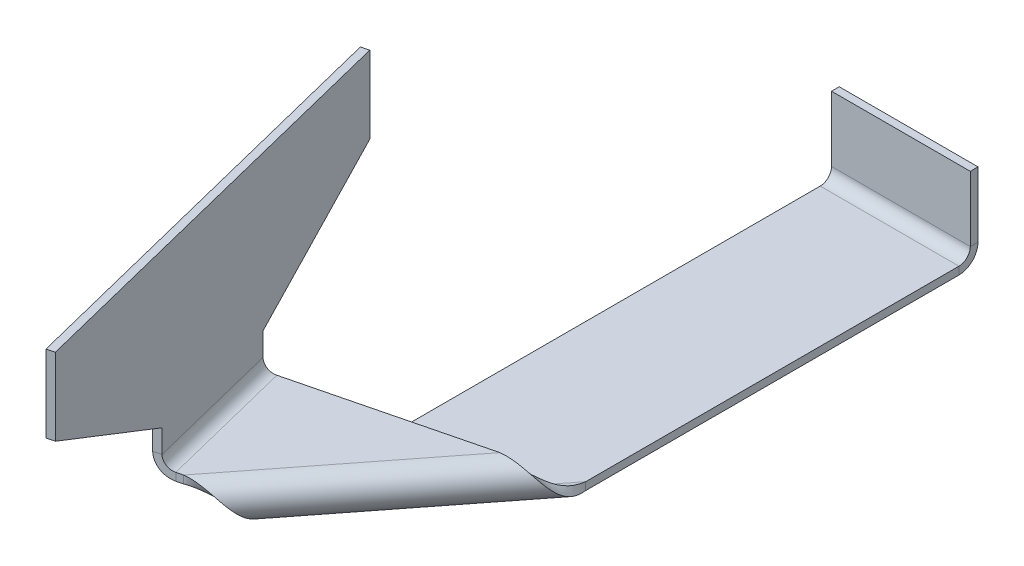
ISO-10303-21;
HEADER;
FILE_DESCRIPTION(('STEP AP214'),'2;1');
FILE_NAME('part.step','',(''),(''),'','','');
FILE_SCHEMA(('AUTOMOTIVE_DESIGN { 1 0 10303 214 1 1 1 1 }'));
ENDSEC;
DATA;
#1=APPLICATION_CONTEXT('core data for automotive mechanical design processes');
#2=APPLICATION_PROTOCOL_DEFINITION('international standard','automotive_design',2000,#1);
#3=PRODUCT_CONTEXT('',#1,'mechanical');
#4=PRODUCT('Part','Part','',(#3));
#5=PRODUCT_RELATED_PRODUCT_CATEGORY('part','',(#4));
#6=PRODUCT_DEFINITION_FORMATION('','',#4);
#7=PRODUCT_DEFINITION_CONTEXT('part definition',#1,'design');
#8=PRODUCT_DEFINITION('design','',#6,#7);
#9=PRODUCT_DEFINITION_SHAPE('','',#8);
#10=(LENGTH_UNIT() NAMED_UNIT(*) SI_UNIT(.MILLI.,.METRE.));
#11=(NAMED_UNIT(*) PLANE_ANGLE_UNIT() SI_UNIT($,.RADIAN.));
#12=(NAMED_UNIT(*) SI_UNIT($,.STERADIAN.) SOLID_ANGLE_UNIT());
#13=UNCERTAINTY_MEASURE_WITH_UNIT(LENGTH_MEASURE(1.E-05),#10,'distance_accuracy_value','');
#14=(GEOMETRIC_REPRESENTATION_CONTEXT(3) GLOBAL_UNCERTAINTY_ASSIGNED_CONTEXT((#13)) GLOBAL_UNIT_ASSIGNED_CONTEXT((#10,
#11,#12)) REPRESENTATION_CONTEXT('',''));
#15=CARTESIAN_POINT('',(0.,0.,0.));
#16=DIRECTION('',(0.,0.,1.));
#17=DIRECTION('',(1.,0.,0.));
#18=AXIS2_PLACEMENT_3D('',#15,#16,#17);
#19=CARTESIAN_POINT('',(42.7119081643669,-3.48852617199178,28.3319261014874));
#20=DIRECTION('',(0.,1.,0.));
#21=DIRECTION('',(0.241921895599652,0.,0.970295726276));
#22=AXIS2_PLACEMENT_3D('',#19,#20,#21);
#23=PLANE('',#22);
#24=DIRECTION('',(-0.970295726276,0.,0.241921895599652));
#25=VECTOR('',#24,1.);
#26=CARTESIAN_POINT('',(42.7119081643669,-3.48852617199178,28.3319261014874));
#27=LINE('',#26,#25);
#28=CARTESIAN_POINT('',(-2.44243563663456,-3.48852617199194,39.5901684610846));
#29=VERTEX_POINT('',#28);
#30=CARTESIAN_POINT('',(-2.84553811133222,-3.48852617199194,39.6906731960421));
#31=VERTEX_POINT('',#30);
#32=EDGE_CURVE('E89',#29,#31,#27,.T.);
#33=ORIENTED_EDGE('',*,*,#32,.T.);
#34=DIRECTION('',(-0.241921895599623,0.,-0.970295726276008));
#35=VECTOR('',#34,1.);
#36=CARTESIAN_POINT('',(-2.84553811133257,-3.48852617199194,39.6906731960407));
#37=LINE('',#36,#35);
#38=CARTESIAN_POINT('',(-5.02283517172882,-3.48852617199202,30.9580116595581));
#39=VERTEX_POINT('',#38);
#40=EDGE_CURVE('E81',#31,#39,#37,.T.);
#41=ORIENTED_EDGE('',*,*,#40,.T.);
#42=DIRECTION('',(0.970295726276,0.,-0.241921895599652));
#43=VECTOR('',#42,1.);
#44=CARTESIAN_POINT('',(40.53461110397,-3.48852617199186,19.5992645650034));
#45=LINE('',#44,#43);
#46=CARTESIAN_POINT('',(6.55756436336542,-3.48852617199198,28.0706937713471));
#47=VERTEX_POINT('',#46);
#48=EDGE_CURVE('E97',#39,#47,#45,.T.);
#49=ORIENTED_EDGE('',*,*,#48,.T.);
#50=DIRECTION('',(0.615661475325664,0.,-0.788010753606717));
#51=VECTOR('',#50,1.);
#52=CARTESIAN_POINT('',(20.1347362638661,-3.48852617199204,10.6927062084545));
#53=LINE('',#52,#51);
#54=EDGE_CURVE('E519',#29,#47,#53,.T.);
#55=ORIENTED_EDGE('',*,*,#54,.F.);
#56=EDGE_LOOP('',(#33,#41,#49,#55));
#57=FACE_BOUND('',#56,.T.);
#58=ADVANCED_FACE('F71',(#57),#23,.F.);
#59=CARTESIAN_POINT('',(0.,-5.46172617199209,-5.03827382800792));
#60=DIRECTION('',(0.,-1.,0.));
#61=DIRECTION('',(-1.,0.,0.));
#62=AXIS2_PLACEMENT_3D('',#59,#60,#61);
#63=PLANE('',#62);
#64=DIRECTION('',(0.,0.,1.));
#65=VECTOR('',#64,1.);
#66=CARTESIAN_POINT('',(0.,-5.46172617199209,-5.03827382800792));
#67=LINE('',#66,#65);
#68=CARTESIAN_POINT('',(0.,-5.46172617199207,0.736600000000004));
#69=VERTEX_POINT('',#68);
#70=CARTESIAN_POINT('',(0.,-5.46172617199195,36.4639934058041));
#71=VERTEX_POINT('',#70);
#72=EDGE_CURVE('E490',#69,#71,#67,.T.);
#73=ORIENTED_EDGE('',*,*,#72,.F.);
#74=DIRECTION('',(1.,0.,0.));
#75=VECTOR('',#74,1.);
#76=CARTESIAN_POINT('',(0.,-5.46172617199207,0.736600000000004));
#77=LINE('',#76,#75);
#78=CARTESIAN_POINT('',(9.,-5.46172617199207,0.736600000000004));
#79=VERTEX_POINT('',#78);
#80=EDGE_CURVE('E498',#69,#79,#77,.T.);
#81=ORIENTED_EDGE('',*,*,#80,.T.);
#82=DIRECTION('',(0.,0.,-1.));
#83=VECTOR('',#82,1.);
#84=CARTESIAN_POINT('',(9.,-5.46172617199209,-5.03827382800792));
#85=LINE('',#84,#83);
#86=CARTESIAN_POINT('',(9.00000000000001,-5.46172617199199,24.9445187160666));
#87=VERTEX_POINT('',#86);
#88=EDGE_CURVE('E463',#87,#79,#85,.T.);
#89=ORIENTED_EDGE('',*,*,#88,.F.);
#90=DIRECTION('',(0.615661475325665,0.,-0.788010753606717));
#91=VECTOR('',#90,1.);
#92=CARTESIAN_POINT('',(20.1347362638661,-5.46172617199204,10.6927062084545));
#93=LINE('',#92,#91);
#94=EDGE_CURVE('E417',#71,#87,#93,.T.);
#95=ORIENTED_EDGE('',*,*,#94,.F.);
#96=EDGE_LOOP('',(#73,#81,#89,#95));
#97=FACE_BOUND('',#96,.T.);
#98=ADVANCED_FACE('F387',(#97),#63,.T.);
#99=CARTESIAN_POINT('',(0.,-5.46172617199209,-5.03827382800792));
#100=DIRECTION('',(-1.,0.,0.));
#101=DIRECTION('',(0.,0.,1.));
#102=AXIS2_PLACEMENT_3D('',#99,#100,#101);
#103=PLANE('',#102);
#104=DIRECTION('',(0.,0.,1.));
#105=VECTOR('',#104,1.);
#106=CARTESIAN_POINT('',(0.,-4.96172617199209,-5.03827382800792));
#107=LINE('',#106,#105);
#108=CARTESIAN_POINT('',(0.,-4.96172617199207,0.736600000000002));
#109=VERTEX_POINT('',#108);
#110=CARTESIAN_POINT('',(0.,-4.96172617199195,36.4639934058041));
#111=VERTEX_POINT('',#110);
#112=EDGE_CURVE('E489',#109,#111,#107,.T.);
#113=ORIENTED_EDGE('',*,*,#112,.F.);
#114=DIRECTION('',(0.,-1.,0.));
#115=VECTOR('',#114,1.);
#116=CARTESIAN_POINT('',(0.,-5.46172617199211,0.736600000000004));
#117=LINE('',#116,#115);
#118=EDGE_CURVE('E527',#109,#69,#117,.T.);
#119=ORIENTED_EDGE('',*,*,#118,.T.);
#120=ORIENTED_EDGE('',*,*,#72,.T.);
#121=CARTESIAN_POINT('',(0.,-4.96172617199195,36.4639934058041));
#122=CARTESIAN_POINT('',(0.,-5.46172617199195,36.4639934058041));
#123=B_SPLINE_CURVE_WITH_KNOTS('',1,(#121,#122),.UNSPECIFIED.,.F.,.F.,(2,2),(0.,1.),.UNSPECIFIED.);
#124=EDGE_CURVE('E431',#111,#71,#123,.T.);
#125=ORIENTED_EDGE('',*,*,#124,.F.);
#126=EDGE_LOOP('',(#113,#119,#120,#125));
#127=FACE_BOUND('',#126,.T.);
#128=ADVANCED_FACE('F437',(#127),#103,.T.);
#129=CARTESIAN_POINT('',(9.,-5.46172617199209,-5.03827382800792));
#130=DIRECTION('',(1.,0.,0.));
#131=DIRECTION('',(0.,0.,-1.));
#132=AXIS2_PLACEMENT_3D('',#129,#130,#131);
#133=PLANE('',#132);
#134=ORIENTED_EDGE('',*,*,#88,.T.);
#135=DIRECTION('',(0.,1.,0.));
#136=VECTOR('',#135,1.);
#137=CARTESIAN_POINT('',(9.,-5.46172617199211,0.736600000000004));
#138=LINE('',#137,#136);
#139=CARTESIAN_POINT('',(9.,-4.96172617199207,0.736600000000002));
#140=VERTEX_POINT('',#139);
#141=EDGE_CURVE('E478',#79,#140,#138,.T.);
#142=ORIENTED_EDGE('',*,*,#141,.T.);
#143=DIRECTION('',(0.,0.,-1.));
#144=VECTOR('',#143,1.);
#145=CARTESIAN_POINT('',(9.,-4.96172617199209,-5.03827382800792));
#146=LINE('',#145,#144);
#147=CARTESIAN_POINT('',(9.00000000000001,-4.96172617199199,24.9445187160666));
#148=VERTEX_POINT('',#147);
#149=EDGE_CURVE('E472',#148,#140,#146,.T.);
#150=ORIENTED_EDGE('',*,*,#149,.F.);
#151=CARTESIAN_POINT('',(9.00000000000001,-5.46172617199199,24.9445187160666));
#152=CARTESIAN_POINT('',(9.00000000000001,-4.96172617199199,24.9445187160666));
#153=B_SPLINE_CURVE_WITH_KNOTS('',1,(#151,#152),.UNSPECIFIED.,.F.,.F.,(2,2),(0.,1.),.UNSPECIFIED.);
#154=EDGE_CURVE('E413',#87,#148,#153,.T.);
#155=ORIENTED_EDGE('',*,*,#154,.F.);
#156=EDGE_LOOP('',(#134,#142,#150,#155));
#157=FACE_BOUND('',#156,.T.);
#158=ADVANCED_FACE('F446',(#157),#133,.T.);
#159=CARTESIAN_POINT('',(42.7119081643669,-2.98852617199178,28.3319261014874));
#160=DIRECTION('',(0.241921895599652,0.,0.970295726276));
#161=DIRECTION('',(-0.970295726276,0.,0.241921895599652));
#162=AXIS2_PLACEMENT_3D('',#159,#160,#161);
#163=PLANE('',#162);
#164=DIRECTION('',(0.,1.,0.));
#165=VECTOR('',#164,1.);
#166=CARTESIAN_POINT('',(-2.84553811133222,-2.98852617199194,39.6906731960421));
#167=LINE('',#166,#165);
#168=CARTESIAN_POINT('',(-2.84553811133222,-2.98852617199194,39.6906731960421));
#169=VERTEX_POINT('',#168);
#170=EDGE_CURVE('E12',#31,#169,#167,.T.);
#171=ORIENTED_EDGE('',*,*,#170,.F.);
#172=ORIENTED_EDGE('',*,*,#32,.F.);
#173=CARTESIAN_POINT('',(-2.44243563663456,-2.98852617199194,39.5901684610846));
#174=CARTESIAN_POINT('',(-2.44243563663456,-3.48852617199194,39.5901684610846));
#175=B_SPLINE_CURVE_WITH_KNOTS('',1,(#173,#174),.UNSPECIFIED.,.F.,.F.,(2,2),(0.,1.),.UNSPECIFIED.);
#176=CARTESIAN_POINT('',(-2.44243563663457,-2.98852617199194,39.5901684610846));
#177=VERTEX_POINT('',#176);
#178=EDGE_CURVE('E522',#29,#177,#175,.F.);
#179=ORIENTED_EDGE('',*,*,#178,.T.);
#180=DIRECTION('',(-0.970295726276,0.,0.241921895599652));
#181=VECTOR('',#180,1.);
#182=CARTESIAN_POINT('',(42.7119081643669,-2.98852617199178,28.3319261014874));
#183=LINE('',#182,#181);
#184=EDGE_CURVE('E504',#177,#169,#183,.T.);
#185=ORIENTED_EDGE('',*,*,#184,.T.);
#186=EDGE_LOOP('',(#171,#172,#179,#185));
#187=FACE_BOUND('',#186,.T.);
#188=ADVANCED_FACE('F73',(#187),#163,.T.);
#189=CARTESIAN_POINT('',(40.53461110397,-2.98852617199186,19.5992645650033));
#190=DIRECTION('',(-0.241921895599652,0.,-0.970295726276));
#191=DIRECTION('',(0.970295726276,0.,-0.241921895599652));
#192=AXIS2_PLACEMENT_3D('',#189,#190,#191);
#193=PLANE('',#192);
#194=DIRECTION('',(0.,-1.,0.));
#195=VECTOR('',#194,1.);
#196=CARTESIAN_POINT('',(-5.02283517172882,-2.98852617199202,30.9580116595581));
#197=LINE('',#196,#195);
#198=CARTESIAN_POINT('',(-5.02283517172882,-2.98852617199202,30.9580116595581));
#199=VERTEX_POINT('',#198);
#200=EDGE_CURVE('E537',#199,#39,#197,.T.);
#201=ORIENTED_EDGE('',*,*,#200,.F.);
#202=DIRECTION('',(0.970295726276,0.,-0.241921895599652));
#203=VECTOR('',#202,1.);
#204=CARTESIAN_POINT('',(40.53461110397,-2.98852617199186,19.5992645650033));
#205=LINE('',#204,#203);
#206=CARTESIAN_POINT('',(6.5575643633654,-2.98852617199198,28.0706937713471));
#207=VERTEX_POINT('',#206);
#208=EDGE_CURVE('E502',#199,#207,#205,.T.);
#209=ORIENTED_EDGE('',*,*,#208,.T.);
#210=CARTESIAN_POINT('',(6.55756436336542,-3.48852617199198,28.0706937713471));
#211=CARTESIAN_POINT('',(6.55756436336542,-2.98852617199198,28.0706937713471));
#212=B_SPLINE_CURVE_WITH_KNOTS('',1,(#210,#211),.UNSPECIFIED.,.F.,.F.,(2,2),(0.,1.),.UNSPECIFIED.);
#213=EDGE_CURVE('E521',#207,#47,#212,.F.);
#214=ORIENTED_EDGE('',*,*,#213,.T.);
#215=ORIENTED_EDGE('',*,*,#48,.F.);
#216=EDGE_LOOP('',(#201,#209,#214,#215));
#217=FACE_BOUND('',#216,.T.);
#218=ADVANCED_FACE('F524',(#217),#193,.T.);
#219=CARTESIAN_POINT('',(42.7119081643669,-2.98852617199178,28.3319261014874));
#220=DIRECTION('',(0.,1.,0.));
#221=DIRECTION('',(0.241921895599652,0.,0.970295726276));
#222=AXIS2_PLACEMENT_3D('',#219,#220,#221);
#223=PLANE('',#222);
#224=DIRECTION('',(-0.241921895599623,0.,-0.970295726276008));
#225=VECTOR('',#224,1.);
#226=CARTESIAN_POINT('',(-2.84553811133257,-2.98852617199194,39.6906731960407));
#227=LINE('',#226,#225);
#228=EDGE_CURVE('E507',#169,#199,#227,.T.);
#229=ORIENTED_EDGE('',*,*,#228,.F.);
#230=ORIENTED_EDGE('',*,*,#184,.F.);
#231=DIRECTION('',(0.615661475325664,0.,-0.788010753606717));
#232=VECTOR('',#231,1.);
#233=CARTESIAN_POINT('',(20.1347362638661,-2.98852617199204,10.6927062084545));
#234=LINE('',#233,#232);
#235=EDGE_CURVE('E473',#177,#207,#234,.T.);
#236=ORIENTED_EDGE('',*,*,#235,.T.);
#237=ORIENTED_EDGE('',*,*,#208,.F.);
#238=EDGE_LOOP('',(#229,#230,#236,#237));
#239=FACE_BOUND('',#238,.T.);
#240=ADVANCED_FACE('F450',(#239),#223,.T.);
#241=CARTESIAN_POINT('',(0.,-4.96172617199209,-5.03827382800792));
#242=DIRECTION('',(0.,-1.,0.));
#243=DIRECTION('',(-1.,0.,0.));
#244=AXIS2_PLACEMENT_3D('',#241,#242,#243);
#245=PLANE('',#244);
#246=DIRECTION('',(1.,0.,0.));
#247=VECTOR('',#246,1.);
#248=CARTESIAN_POINT('',(0.,-4.96172617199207,0.736600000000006));
#249=LINE('',#248,#247);
#250=EDGE_CURVE('E531',#109,#140,#249,.T.);
#251=ORIENTED_EDGE('',*,*,#250,.F.);
#252=ORIENTED_EDGE('',*,*,#112,.T.);
#253=DIRECTION('',(0.615661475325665,0.,-0.788010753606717));
#254=VECTOR('',#253,1.);
#255=CARTESIAN_POINT('',(20.1347362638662,-4.96172617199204,10.6927062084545));
#256=LINE('',#255,#254);
#257=EDGE_CURVE('E435',#111,#148,#256,.T.);
#258=ORIENTED_EDGE('',*,*,#257,.T.);
#259=ORIENTED_EDGE('',*,*,#149,.T.);
#260=EDGE_LOOP('',(#251,#252,#258,#259));
#261=FACE_BOUND('',#260,.T.);
#262=ADVANCED_FACE('F447',(#261),#245,.F.);
#263=CARTESIAN_POINT('',(-2.44243563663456,-2.98852617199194,39.5901684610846));
#264=CARTESIAN_POINT('',(-2.21309150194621,-2.98852617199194,39.5595659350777));
#265=CARTESIAN_POINT('',(-1.98383803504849,-3.0207115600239,39.5289295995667));
#266=CARTESIAN_POINT('',(-1.54460945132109,-3.14460192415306,39.4525580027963));
#267=CARTESIAN_POINT('',(-1.33474730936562,-3.23625815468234,39.4067529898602));
#268=CARTESIAN_POINT('',(-0.95081994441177,-3.46517769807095,39.2871753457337));
#269=CARTESIAN_POINT('',(-0.776825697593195,-3.60235094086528,39.2133472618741));
#270=CARTESIAN_POINT('',(-0.47566245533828,-3.90144873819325,39.0291071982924));
#271=CARTESIAN_POINT('',(-0.348531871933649,-4.06325561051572,38.9186652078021));
#272=CARTESIAN_POINT('',(-0.144995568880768,-4.38699673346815,38.6581506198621));
#273=CARTESIAN_POINT('',(-0.0685898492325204,-4.54880360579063,38.5080780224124));
#274=CARTESIAN_POINT('',(0.037319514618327,-4.8479014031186,38.1712889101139));
#275=CARTESIAN_POINT('',(0.0668615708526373,-4.98507464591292,37.9846024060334));
#276=CARTESIAN_POINT('',(0.0900068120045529,-5.21399418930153,37.5831508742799));
#277=CARTESIAN_POINT('',(0.0836809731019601,-5.30565041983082,37.3684412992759));
#278=CARTESIAN_POINT('',(0.0515249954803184,-5.42954078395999,36.9237837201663));
#279=CARTESIAN_POINT('',(0.0257898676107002,-5.46172617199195,36.6939284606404));
#280=CARTESIAN_POINT('',(0.,-5.46172617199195,36.4639934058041));
#281=CARTESIAN_POINT('',(-2.44243563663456,-3.48852617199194,39.5901684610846));
#282=CARTESIAN_POINT('',(-2.26467878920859,-3.48852617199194,39.5192704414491));
#283=CARTESIAN_POINT('',(-2.08696810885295,-3.50769789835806,39.4483555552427));
#284=CARTESIAN_POINT('',(-1.74303803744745,-3.58149511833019,39.2975286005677));
#285=CARTESIAN_POINT('',(-1.5768820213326,-3.63609157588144,39.2175766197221));
#286=CARTESIAN_POINT('',(-1.26589297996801,-3.77245105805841,39.0410133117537));
#287=CARTESIAN_POINT('',(-1.12110223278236,-3.85416043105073,38.9443689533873));
#288=CARTESIAN_POINT('',(-0.859412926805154,-4.03232268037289,38.7292884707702));
#289=CARTESIAN_POINT('',(-0.742537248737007,-4.12870545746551,38.6108344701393));
#290=CARTESIAN_POINT('',(-0.539000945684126,-4.32154688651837,38.3503198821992));
#291=CARTESIAN_POINT('',(-0.452340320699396,-4.41792966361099,38.2082592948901));
#292=CARTESIAN_POINT('',(-0.306957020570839,-4.59609191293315,37.9023106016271));
#293=CARTESIAN_POINT('',(-0.248211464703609,-4.67780128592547,37.7384403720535));
#294=CARTESIAN_POINT('',(-0.152127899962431,-4.81416076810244,37.3939745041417));
#295=CARTESIAN_POINT('',(-0.114747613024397,-4.86875722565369,37.2134118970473));
#296=CARTESIAN_POINT('',(-0.0516050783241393,-4.94255444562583,36.8432096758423));
#297=CARTESIAN_POINT('',(-0.0257887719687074,-4.96172617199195,36.6536218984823));
#298=CARTESIAN_POINT('',(0.,-4.96172617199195,36.4639934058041));
#299=B_SPLINE_SURFACE_WITH_KNOTS('',1,3,((#263,#264,#265,#266,#267,#268,#269,#270,#271,#272,
#273,#274,#275,#276,#277,#278,#279,#280),(#281,#282,#283,#284,#285,#286,#287,#288,#289,#290,
#291,#292,#293,#294,#295,#296,#297,#298)),.UNSPECIFIED.,.F.,.F.,.F.,(2,2),(4,2,2,2,2,2,2,2,4),
(0.,1.),(0.,0.125,0.25,0.375,0.5,0.625,0.75,0.875,1.),.UNSPECIFIED.);
#300=CARTESIAN_POINT('',(-2.44243563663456,-3.48852617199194,39.5901684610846));
#301=CARTESIAN_POINT('',(-2.26467878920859,-3.48852617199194,39.5192704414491));
#302=CARTESIAN_POINT('',(-2.08696810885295,-3.50769789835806,39.4483555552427));
#303=CARTESIAN_POINT('',(-1.74303803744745,-3.58149511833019,39.2975286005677));
#304=CARTESIAN_POINT('',(-1.5768820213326,-3.63609157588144,39.2175766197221));
#305=CARTESIAN_POINT('',(-1.26589297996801,-3.77245105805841,39.0410133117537));
#306=CARTESIAN_POINT('',(-1.12110223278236,-3.85416043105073,38.9443689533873));
#307=CARTESIAN_POINT('',(-0.859412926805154,-4.03232268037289,38.7292884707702));
#308=CARTESIAN_POINT('',(-0.742537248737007,-4.12870545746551,38.6108344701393));
#309=CARTESIAN_POINT('',(-0.539000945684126,-4.32154688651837,38.3503198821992));
#310=CARTESIAN_POINT('',(-0.452340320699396,-4.41792966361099,38.2082592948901));
#311=CARTESIAN_POINT('',(-0.306957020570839,-4.59609191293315,37.9023106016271));
#312=CARTESIAN_POINT('',(-0.248211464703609,-4.67780128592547,37.7384403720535));
#313=CARTESIAN_POINT('',(-0.152127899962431,-4.81416076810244,37.3939745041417));
#314=CARTESIAN_POINT('',(-0.114747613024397,-4.86875722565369,37.2134118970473));
#315=CARTESIAN_POINT('',(-0.0516050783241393,-4.94255444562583,36.8432096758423));
#316=CARTESIAN_POINT('',(-0.0257887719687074,-4.96172617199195,36.6536218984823));
#317=CARTESIAN_POINT('',(0.,-4.96172617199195,36.4639934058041));
#318=B_SPLINE_CURVE_WITH_KNOTS('',3,(#300,#301,#302,#303,#304,#305,#306,#307,#308,#309,#310,
#311,#312,#313,#314,#315,#316,#317),.UNSPECIFIED.,.F.,.F.,(4,2,2,2,2,2,2,2,4),(0.,0.125,0.25,
0.375,0.5,0.625,0.75,0.875,1.),.UNSPECIFIED.);
#319=EDGE_CURVE('E271',#29,#111,#318,.T.);
#320=CARTESIAN_POINT('',(0.,-5.46172617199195,36.4639934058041));
#321=CARTESIAN_POINT('',(0.0257898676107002,-5.46172617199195,36.6939284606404));
#322=CARTESIAN_POINT('',(0.0515249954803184,-5.42954078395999,36.9237837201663));
#323=CARTESIAN_POINT('',(0.0836809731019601,-5.30565041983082,37.3684412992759));
#324=CARTESIAN_POINT('',(0.0900068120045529,-5.21399418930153,37.5831508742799));
#325=CARTESIAN_POINT('',(0.0668615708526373,-4.98507464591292,37.9846024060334));
#326=CARTESIAN_POINT('',(0.037319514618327,-4.8479014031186,38.1712889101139));
#327=CARTESIAN_POINT('',(-0.0685898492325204,-4.54880360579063,38.5080780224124));
#328=CARTESIAN_POINT('',(-0.144995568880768,-4.38699673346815,38.6581506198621));
#329=CARTESIAN_POINT('',(-0.348531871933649,-4.06325561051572,38.9186652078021));
#330=CARTESIAN_POINT('',(-0.47566245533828,-3.90144873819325,39.0291071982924));
#331=CARTESIAN_POINT('',(-0.776825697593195,-3.60235094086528,39.2133472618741));
#332=CARTESIAN_POINT('',(-0.95081994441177,-3.46517769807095,39.2871753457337));
#333=CARTESIAN_POINT('',(-1.33474730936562,-3.23625815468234,39.4067529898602));
#334=CARTESIAN_POINT('',(-1.54460945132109,-3.14460192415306,39.4525580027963));
#335=CARTESIAN_POINT('',(-1.98383803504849,-3.0207115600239,39.5289295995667));
#336=CARTESIAN_POINT('',(-2.21309150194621,-2.98852617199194,39.5595659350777));
#337=CARTESIAN_POINT('',(-2.44243563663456,-2.98852617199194,39.5901684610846));
#338=B_SPLINE_CURVE_WITH_KNOTS('',3,(#320,#321,#322,#323,#324,#325,#326,#327,#328,#329,#330,
#331,#332,#333,#334,#335,#336,#337),.UNSPECIFIED.,.F.,.F.,(4,2,2,2,2,2,2,2,4),(0.,0.125,0.25,
0.375,0.5,0.625,0.75,0.875,1.),.UNSPECIFIED.);
#339=EDGE_CURVE('E654',#177,#71,#338,.F.);
#340=ORIENTED_EDGE('',*,*,#178,.F.);
#341=ORIENTED_EDGE('',*,*,#319,.T.);
#342=ORIENTED_EDGE('',*,*,#124,.T.);
#343=ORIENTED_EDGE('',*,*,#339,.F.);
#344=EDGE_LOOP('',(#340,#341,#342,#343));
#345=FACE_BOUND('',#344,.T.);
#346=ADVANCED_FACE('F383',(#345),#299,.T.);
#347=CARTESIAN_POINT('',(9.00000000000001,-5.46172617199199,24.9445187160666));
#348=CARTESIAN_POINT('',(9.0257898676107,-5.46172617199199,25.1744537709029));
#349=CARTESIAN_POINT('',(9.05152499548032,-5.42954078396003,25.4043090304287));
#350=CARTESIAN_POINT('',(9.08368097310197,-5.30565041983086,25.8489666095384));
#351=CARTESIAN_POINT('',(9.09000681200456,-5.21399418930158,26.0636761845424));
#352=CARTESIAN_POINT('',(9.06686157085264,-4.98507464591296,26.4651277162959));
#353=CARTESIAN_POINT('',(9.03731951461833,-4.84790140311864,26.6518142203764));
#354=CARTESIAN_POINT('',(8.93141015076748,-4.54880360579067,26.9886033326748));
#355=CARTESIAN_POINT('',(8.85500443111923,-4.38699673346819,27.1386759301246));
#356=CARTESIAN_POINT('',(8.65146812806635,-4.06325561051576,27.3991905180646));
#357=CARTESIAN_POINT('',(8.52433754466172,-3.90144873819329,27.5096325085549));
#358=CARTESIAN_POINT('',(8.2231743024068,-3.60235094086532,27.6938725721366));
#359=CARTESIAN_POINT('',(8.04918005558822,-3.46517769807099,27.7677006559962));
#360=CARTESIAN_POINT('',(7.66525269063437,-3.23625815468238,27.8872783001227));
#361=CARTESIAN_POINT('',(7.4553905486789,-3.1446019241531,27.9330833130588));
#362=CARTESIAN_POINT('',(7.01616196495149,-3.02071156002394,28.0094549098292));
#363=CARTESIAN_POINT('',(6.78690849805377,-2.98852617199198,28.0400912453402));
#364=CARTESIAN_POINT('',(6.55756436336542,-2.98852617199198,28.0706937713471));
#365=CARTESIAN_POINT('',(9.00000000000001,-4.96172617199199,24.9445187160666));
#366=CARTESIAN_POINT('',(8.9742112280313,-4.96172617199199,25.1341472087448));
#367=CARTESIAN_POINT('',(8.94839492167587,-4.94255444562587,25.3237349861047));
#368=CARTESIAN_POINT('',(8.88525238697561,-4.86875722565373,25.6939372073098));
#369=CARTESIAN_POINT('',(8.84787210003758,-4.81416076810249,25.8744998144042));
#370=CARTESIAN_POINT('',(8.75178853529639,-4.67780128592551,26.218965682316));
#371=CARTESIAN_POINT('',(8.69304297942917,-4.59609191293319,26.3828359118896));
#372=CARTESIAN_POINT('',(8.54765967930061,-4.41792966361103,26.6887846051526));
#373=CARTESIAN_POINT('',(8.46099905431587,-4.32154688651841,26.8308451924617));
#374=CARTESIAN_POINT('',(8.25746275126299,-4.12870545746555,27.0913597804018));
#375=CARTESIAN_POINT('',(8.14058707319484,-4.03232268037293,27.2098137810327));
#376=CARTESIAN_POINT('',(7.87889776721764,-3.85416043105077,27.4248942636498));
#377=CARTESIAN_POINT('',(7.73410702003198,-3.77245105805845,27.5215386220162));
#378=CARTESIAN_POINT('',(7.42311797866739,-3.63609157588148,27.6981019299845));
#379=CARTESIAN_POINT('',(7.25696196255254,-3.58149511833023,27.7780539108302));
#380=CARTESIAN_POINT('',(6.91303189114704,-3.50769789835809,27.9288808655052));
#381=CARTESIAN_POINT('',(6.73532121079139,-3.48852617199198,27.9997957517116));
#382=CARTESIAN_POINT('',(6.55756436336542,-3.48852617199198,28.0706937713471));
#383=B_SPLINE_SURFACE_WITH_KNOTS('',1,3,((#347,#348,#349,#350,#351,#352,#353,#354,#355,#356,
#357,#358,#359,#360,#361,#362,#363,#364),(#365,#366,#367,#368,#369,#370,#371,#372,#373,#374,
#375,#376,#377,#378,#379,#380,#381,#382)),.UNSPECIFIED.,.F.,.F.,.F.,(2,2),(4,2,2,2,2,2,2,2,4),
(0.,1.),(0.,0.125,0.25,0.375,0.5,0.625,0.75,0.875,1.),.UNSPECIFIED.);
#384=CARTESIAN_POINT('',(9.00000000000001,-4.96172617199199,24.9445187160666));
#385=CARTESIAN_POINT('',(8.9742112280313,-4.96172617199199,25.1341472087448));
#386=CARTESIAN_POINT('',(8.94839492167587,-4.94255444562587,25.3237349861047));
#387=CARTESIAN_POINT('',(8.88525238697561,-4.86875722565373,25.6939372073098));
#388=CARTESIAN_POINT('',(8.84787210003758,-4.81416076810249,25.8744998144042));
#389=CARTESIAN_POINT('',(8.75178853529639,-4.67780128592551,26.218965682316));
#390=CARTESIAN_POINT('',(8.69304297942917,-4.59609191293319,26.3828359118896));
#391=CARTESIAN_POINT('',(8.54765967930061,-4.41792966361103,26.6887846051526));
#392=CARTESIAN_POINT('',(8.46099905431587,-4.32154688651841,26.8308451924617));
#393=CARTESIAN_POINT('',(8.25746275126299,-4.12870545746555,27.0913597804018));
#394=CARTESIAN_POINT('',(8.14058707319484,-4.03232268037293,27.2098137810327));
#395=CARTESIAN_POINT('',(7.87889776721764,-3.85416043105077,27.4248942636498));
#396=CARTESIAN_POINT('',(7.73410702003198,-3.77245105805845,27.5215386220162));
#397=CARTESIAN_POINT('',(7.42311797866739,-3.63609157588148,27.6981019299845));
#398=CARTESIAN_POINT('',(7.25696196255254,-3.58149511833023,27.7780539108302));
#399=CARTESIAN_POINT('',(6.91303189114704,-3.50769789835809,27.9288808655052));
#400=CARTESIAN_POINT('',(6.73532121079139,-3.48852617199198,27.9997957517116));
#401=CARTESIAN_POINT('',(6.55756436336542,-3.48852617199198,28.0706937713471));
#402=B_SPLINE_CURVE_WITH_KNOTS('',3,(#384,#385,#386,#387,#388,#389,#390,#391,#392,#393,#394,
#395,#396,#397,#398,#399,#400,#401),.UNSPECIFIED.,.F.,.F.,(4,2,2,2,2,2,2,2,4),(0.,0.125,0.25,
0.375,0.5,0.625,0.75,0.875,1.),.UNSPECIFIED.);
#403=EDGE_CURVE('E356',#148,#47,#402,.T.);
#404=CARTESIAN_POINT('',(6.55756436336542,-2.98852617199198,28.0706937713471));
#405=CARTESIAN_POINT('',(6.78690849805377,-2.98852617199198,28.0400912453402));
#406=CARTESIAN_POINT('',(7.01616196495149,-3.02071156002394,28.0094549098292));
#407=CARTESIAN_POINT('',(7.4553905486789,-3.1446019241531,27.9330833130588));
#408=CARTESIAN_POINT('',(7.66525269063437,-3.23625815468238,27.8872783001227));
#409=CARTESIAN_POINT('',(8.04918005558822,-3.46517769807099,27.7677006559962));
#410=CARTESIAN_POINT('',(8.2231743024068,-3.60235094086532,27.6938725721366));
#411=CARTESIAN_POINT('',(8.52433754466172,-3.90144873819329,27.5096325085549));
#412=CARTESIAN_POINT('',(8.65146812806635,-4.06325561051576,27.3991905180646));
#413=CARTESIAN_POINT('',(8.85500443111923,-4.38699673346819,27.1386759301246));
#414=CARTESIAN_POINT('',(8.93141015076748,-4.54880360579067,26.9886033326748));
#415=CARTESIAN_POINT('',(9.03731951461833,-4.84790140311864,26.6518142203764));
#416=CARTESIAN_POINT('',(9.06686157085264,-4.98507464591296,26.4651277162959));
#417=CARTESIAN_POINT('',(9.09000681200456,-5.21399418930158,26.0636761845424));
#418=CARTESIAN_POINT('',(9.08368097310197,-5.30565041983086,25.8489666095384));
#419=CARTESIAN_POINT('',(9.05152499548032,-5.42954078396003,25.4043090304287));
#420=CARTESIAN_POINT('',(9.0257898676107,-5.46172617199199,25.1744537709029));
#421=CARTESIAN_POINT('',(9.00000000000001,-5.46172617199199,24.9445187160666));
#422=B_SPLINE_CURVE_WITH_KNOTS('',3,(#404,#405,#406,#407,#408,#409,#410,#411,#412,#413,#414,
#415,#416,#417,#418,#419,#420,#421),.UNSPECIFIED.,.F.,.F.,(4,2,2,2,2,2,2,2,4),(0.,0.125,0.25,
0.375,0.5,0.625,0.75,0.875,1.),.UNSPECIFIED.);
#423=EDGE_CURVE('E348',#87,#207,#422,.F.);
#424=ORIENTED_EDGE('',*,*,#403,.T.);
#425=ORIENTED_EDGE('',*,*,#213,.F.);
#426=ORIENTED_EDGE('',*,*,#423,.F.);
#427=ORIENTED_EDGE('',*,*,#154,.T.);
#428=EDGE_LOOP('',(#424,#425,#426,#427));
#429=FACE_BOUND('',#428,.T.);
#430=ADVANCED_FACE('F324',(#429),#383,.T.);
#431=CARTESIAN_POINT('',(16.1045453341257,-4.22512617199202,15.8511153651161));
#432=DIRECTION('',(-0.615661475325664,0.,0.788010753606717));
#433=DIRECTION('',(0.788010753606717,0.,0.615661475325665));
#434=AXIS2_PLACEMENT_3D('',#431,#432,#433);
#435=CYLINDRICAL_SURFACE('',#434,1.2366);
#436=ORIENTED_EDGE('',*,*,#94,.T.);
#437=ORIENTED_EDGE('',*,*,#423,.T.);
#438=ORIENTED_EDGE('',*,*,#235,.F.);
#439=ORIENTED_EDGE('',*,*,#339,.T.);
#440=EDGE_LOOP('',(#436,#437,#438,#439));
#441=FACE_BOUND('',#440,.T.);
#442=ADVANCED_FACE('F313',(#441),#435,.T.);
#443=CARTESIAN_POINT('',(16.1045453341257,-4.22512617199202,15.8511153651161));
#444=DIRECTION('',(-0.615661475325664,0.,0.788010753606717));
#445=DIRECTION('',(0.788010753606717,0.,0.615661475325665));
#446=AXIS2_PLACEMENT_3D('',#443,#444,#445);
#447=CYLINDRICAL_SURFACE('',#446,0.7366);
#448=ORIENTED_EDGE('',*,*,#257,.F.);
#449=ORIENTED_EDGE('',*,*,#319,.F.);
#450=ORIENTED_EDGE('',*,*,#54,.T.);
#451=ORIENTED_EDGE('',*,*,#403,.F.);
#452=EDGE_LOOP('',(#448,#449,#450,#451));
#453=FACE_BOUND('',#452,.T.);
#454=ADVANCED_FACE('F323',(#453),#447,.F.);
#455=CARTESIAN_POINT('',(0.,0.,-0.5));
#456=DIRECTION('',(0.,1.,0.));
#457=DIRECTION('',(0.,0.,1.));
#458=AXIS2_PLACEMENT_3D('',#455,#456,#457);
#459=PLANE('',#458);
#460=DIRECTION('',(-1.,0.,0.));
#461=VECTOR('',#460,1.);
#462=CARTESIAN_POINT('',(0.,0.,0.));
#463=LINE('',#462,#461);
#464=CARTESIAN_POINT('',(9.,0.,0.));
#465=VERTEX_POINT('',#464);
#466=CARTESIAN_POINT('',(0.,0.,0.));
#467=VERTEX_POINT('',#466);
#468=EDGE_CURVE('E274',#465,#467,#463,.T.);
#469=ORIENTED_EDGE('',*,*,#468,.F.);
#470=DIRECTION('',(0.,0.,1.));
#471=VECTOR('',#470,1.);
#472=CARTESIAN_POINT('',(9.,0.,-0.5));
#473=LINE('',#472,#471);
#474=CARTESIAN_POINT('',(9.,0.,-0.5));
#475=VERTEX_POINT('',#474);
#476=EDGE_CURVE('E268',#475,#465,#473,.T.);
#477=ORIENTED_EDGE('',*,*,#476,.F.);
#478=DIRECTION('',(-1.,0.,0.));
#479=VECTOR('',#478,1.);
#480=CARTESIAN_POINT('',(0.,0.,-0.5));
#481=LINE('',#480,#479);
#482=CARTESIAN_POINT('',(0.,0.,-0.5));
#483=VERTEX_POINT('',#482);
#484=EDGE_CURVE('E296',#475,#483,#481,.T.);
#485=ORIENTED_EDGE('',*,*,#484,.T.);
#486=DIRECTION('',(0.,0.,1.));
#487=VECTOR('',#486,1.);
#488=CARTESIAN_POINT('',(0.,0.,-0.5));
#489=LINE('',#488,#487);
#490=EDGE_CURVE('E292',#483,#467,#489,.T.);
#491=ORIENTED_EDGE('',*,*,#490,.T.);
#492=EDGE_LOOP('',(#469,#477,#485,#491));
#493=FACE_BOUND('',#492,.T.);
#494=ADVANCED_FACE('F673',(#493),#459,.T.);
#495=CARTESIAN_POINT('',(0.,0.,-0.5));
#496=DIRECTION('',(0.,0.,-1.));
#497=DIRECTION('',(-1.,0.,0.));
#498=AXIS2_PLACEMENT_3D('',#495,#496,#497);
#499=PLANE('',#498);
#500=DIRECTION('',(1.,0.,0.));
#501=VECTOR('',#500,1.);
#502=CARTESIAN_POINT('',(0.,-4.22512617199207,-0.5));
#503=LINE('',#502,#501);
#504=CARTESIAN_POINT('',(0.,-4.22512617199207,-0.5));
#505=VERTEX_POINT('',#504);
#506=CARTESIAN_POINT('',(9.,-4.22512617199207,-0.5));
#507=VERTEX_POINT('',#506);
#508=EDGE_CURVE('E263',#505,#507,#503,.T.);
#509=ORIENTED_EDGE('',*,*,#508,.F.);
#510=DIRECTION('',(0.,-1.,0.));
#511=VECTOR('',#510,1.);
#512=CARTESIAN_POINT('',(0.,0.,-0.5));
#513=LINE('',#512,#511);
#514=EDGE_CURVE('E288',#483,#505,#513,.T.);
#515=ORIENTED_EDGE('',*,*,#514,.F.);
#516=ORIENTED_EDGE('',*,*,#484,.F.);
#517=DIRECTION('',(0.,1.,0.));
#518=VECTOR('',#517,1.);
#519=CARTESIAN_POINT('',(9.,0.,-0.5));
#520=LINE('',#519,#518);
#521=EDGE_CURVE('E272',#507,#475,#520,.T.);
#522=ORIENTED_EDGE('',*,*,#521,.F.);
#523=EDGE_LOOP('',(#509,#515,#516,#522));
#524=FACE_BOUND('',#523,.T.);
#525=ADVANCED_FACE('F677',(#524),#499,.T.);
#526=CARTESIAN_POINT('',(0.,0.,-0.5));
#527=DIRECTION('',(-1.,0.,0.));
#528=DIRECTION('',(0.,-1.,0.));
#529=AXIS2_PLACEMENT_3D('',#526,#527,#528);
#530=PLANE('',#529);
#531=DIRECTION('',(0.,0.,-1.));
#532=VECTOR('',#531,1.);
#533=CARTESIAN_POINT('',(0.,-4.22512617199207,-0.50000000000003));
#534=LINE('',#533,#532);
#535=CARTESIAN_POINT('',(0.,-4.22512617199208,0.));
#536=VERTEX_POINT('',#535);
#537=EDGE_CURVE('E299',#536,#505,#534,.T.);
#538=ORIENTED_EDGE('',*,*,#537,.F.);
#539=DIRECTION('',(0.,-1.,0.));
#540=VECTOR('',#539,1.);
#541=CARTESIAN_POINT('',(0.,0.,0.));
#542=LINE('',#541,#540);
#543=EDGE_CURVE('E286',#467,#536,#542,.T.);
#544=ORIENTED_EDGE('',*,*,#543,.F.);
#545=ORIENTED_EDGE('',*,*,#490,.F.);
#546=ORIENTED_EDGE('',*,*,#514,.T.);
#547=EDGE_LOOP('',(#538,#544,#545,#546));
#548=FACE_BOUND('',#547,.T.);
#549=ADVANCED_FACE('F683',(#548),#530,.T.);
#550=CARTESIAN_POINT('',(0.,0.,0.));
#551=DIRECTION('',(0.,0.,-1.));
#552=DIRECTION('',(-1.,0.,0.));
#553=AXIS2_PLACEMENT_3D('',#550,#551,#552);
#554=PLANE('',#553);
#555=ORIENTED_EDGE('',*,*,#543,.T.);
#556=DIRECTION('',(1.,0.,0.));
#557=VECTOR('',#556,1.);
#558=CARTESIAN_POINT('',(0.,-4.22512617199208,0.));
#559=LINE('',#558,#557);
#560=CARTESIAN_POINT('',(9.,-4.22512617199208,0.));
#561=VERTEX_POINT('',#560);
#562=EDGE_CURVE('E281',#536,#561,#559,.T.);
#563=ORIENTED_EDGE('',*,*,#562,.T.);
#564=DIRECTION('',(0.,1.,0.));
#565=VECTOR('',#564,1.);
#566=CARTESIAN_POINT('',(9.,0.,0.));
#567=LINE('',#566,#565);
#568=EDGE_CURVE('E279',#561,#465,#567,.T.);
#569=ORIENTED_EDGE('',*,*,#568,.T.);
#570=ORIENTED_EDGE('',*,*,#468,.T.);
#571=EDGE_LOOP('',(#555,#563,#569,#570));
#572=FACE_BOUND('',#571,.T.);
#573=ADVANCED_FACE('F692',(#572),#554,.F.);
#574=CARTESIAN_POINT('',(9.,0.,-0.5));
#575=DIRECTION('',(1.,0.,0.));
#576=DIRECTION('',(0.,1.,0.));
#577=AXIS2_PLACEMENT_3D('',#574,#575,#576);
#578=PLANE('',#577);
#579=DIRECTION('',(0.,0.,1.));
#580=VECTOR('',#579,1.);
#581=CARTESIAN_POINT('',(9.,-4.22512617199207,-0.50000000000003));
#582=LINE('',#581,#580);
#583=EDGE_CURVE('E302',#507,#561,#582,.T.);
#584=ORIENTED_EDGE('',*,*,#583,.F.);
#585=ORIENTED_EDGE('',*,*,#521,.T.);
#586=ORIENTED_EDGE('',*,*,#476,.T.);
#587=ORIENTED_EDGE('',*,*,#568,.F.);
#588=EDGE_LOOP('',(#584,#585,#586,#587));
#589=FACE_BOUND('',#588,.T.);
#590=ADVANCED_FACE('F326',(#589),#578,.T.);
#591=CARTESIAN_POINT('',(0.,-4.22512617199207,0.7366));
#592=DIRECTION('',(-1.,0.,0.));
#593=DIRECTION('',(0.,-1.,0.));
#594=AXIS2_PLACEMENT_3D('',#591,#592,#593);
#595=PLANE('',#594);
#596=ORIENTED_EDGE('',*,*,#118,.F.);
#597=CARTESIAN_POINT('',(0.,-4.22512617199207,0.7366));
#598=DIRECTION('',(-1.,0.,0.));
#599=DIRECTION('',(0.,-1.,0.));
#600=AXIS2_PLACEMENT_3D('',#597,#598,#599);
#601=CIRCLE('',#600,0.7366);
#602=EDGE_CURVE('E252',#109,#536,#601,.F.);
#603=ORIENTED_EDGE('',*,*,#602,.T.);
#604=ORIENTED_EDGE('',*,*,#537,.T.);
#605=CARTESIAN_POINT('',(0.,-4.22512617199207,0.7366));
#606=DIRECTION('',(1.,0.,0.));
#607=DIRECTION('',(0.,-1.,0.));
#608=AXIS2_PLACEMENT_3D('',#605,#606,#607);
#609=CIRCLE('',#608,1.2366);
#610=EDGE_CURVE('E257',#69,#505,#609,.T.);
#611=ORIENTED_EDGE('',*,*,#610,.F.);
#612=EDGE_LOOP('',(#596,#603,#604,#611));
#613=FACE_BOUND('',#612,.T.);
#614=ADVANCED_FACE('F699',(#613),#595,.T.);
#615=CARTESIAN_POINT('',(9.,-4.22512617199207,0.7366));
#616=DIRECTION('',(1.,0.,0.));
#617=DIRECTION('',(0.,0.,-1.));
#618=AXIS2_PLACEMENT_3D('',#615,#616,#617);
#619=PLANE('',#618);
#620=CARTESIAN_POINT('',(9.,-4.22512617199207,0.7366));
#621=DIRECTION('',(-1.,0.,0.));
#622=DIRECTION('',(0.,-1.,0.));
#623=AXIS2_PLACEMENT_3D('',#620,#621,#622);
#624=CIRCLE('',#623,0.7366);
#625=EDGE_CURVE('E261',#561,#140,#624,.T.);
#626=ORIENTED_EDGE('',*,*,#625,.T.);
#627=ORIENTED_EDGE('',*,*,#141,.F.);
#628=CARTESIAN_POINT('',(9.,-4.22512617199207,0.7366));
#629=DIRECTION('',(-1.,0.,0.));
#630=DIRECTION('',(0.,0.,-1.));
#631=AXIS2_PLACEMENT_3D('',#628,#629,#630);
#632=CIRCLE('',#631,1.2366);
#633=EDGE_CURVE('E260',#507,#79,#632,.T.);
#634=ORIENTED_EDGE('',*,*,#633,.F.);
#635=ORIENTED_EDGE('',*,*,#583,.T.);
#636=EDGE_LOOP('',(#626,#627,#634,#635));
#637=FACE_BOUND('',#636,.T.);
#638=ADVANCED_FACE('F688',(#637),#619,.T.);
#639=CARTESIAN_POINT('',(13.6461313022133,-4.22512617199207,0.7366));
#640=DIRECTION('',(-1.,0.,0.));
#641=DIRECTION('',(0.,-1.,0.));
#642=AXIS2_PLACEMENT_3D('',#639,#640,#641);
#643=CYLINDRICAL_SURFACE('',#642,1.2366);
#644=ORIENTED_EDGE('',*,*,#508,.T.);
#645=ORIENTED_EDGE('',*,*,#633,.T.);
#646=ORIENTED_EDGE('',*,*,#80,.F.);
#647=ORIENTED_EDGE('',*,*,#610,.T.);
#648=EDGE_LOOP('',(#644,#645,#646,#647));
#649=FACE_BOUND('',#648,.T.);
#650=ADVANCED_FACE('F711',(#649),#643,.T.);
#651=CARTESIAN_POINT('',(13.6461313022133,-4.22512617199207,0.7366));
#652=DIRECTION('',(-1.,0.,0.));
#653=DIRECTION('',(0.,-1.,0.));
#654=AXIS2_PLACEMENT_3D('',#651,#652,#653);
#655=CYLINDRICAL_SURFACE('',#654,0.7366);
#656=ORIENTED_EDGE('',*,*,#562,.F.);
#657=ORIENTED_EDGE('',*,*,#602,.F.);
#658=ORIENTED_EDGE('',*,*,#250,.T.);
#659=ORIENTED_EDGE('',*,*,#625,.F.);
#660=EDGE_LOOP('',(#656,#657,#658,#659));
#661=FACE_BOUND('',#660,.T.);
#662=ADVANCED_FACE('F708',(#661),#655,.F.);
#663=CARTESIAN_POINT('',(-2.84553811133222,-2.25192617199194,39.6906731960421));
#664=DIRECTION('',(-0.241921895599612,0.,-0.97029572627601));
#665=DIRECTION('',(-0.970295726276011,0.,0.241921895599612));
#666=AXIS2_PLACEMENT_3D('',#663,#664,#665);
#667=PLANE('',#666);
#668=DIRECTION('',(0.970295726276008,0.,-0.241921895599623));
#669=VECTOR('',#668,1.);
#670=CARTESIAN_POINT('',(-3.56025794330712,-2.25192617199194,39.8688728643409));
#671=LINE('',#670,#669);
#672=CARTESIAN_POINT('',(-4.04540580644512,-2.25192617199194,39.9898338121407));
#673=VERTEX_POINT('',#672);
#674=CARTESIAN_POINT('',(-3.56025794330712,-2.25192617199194,39.8688728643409));
#675=VERTEX_POINT('',#674);
#676=EDGE_CURVE('E219',#673,#675,#671,.T.);
#677=ORIENTED_EDGE('',*,*,#676,.F.);
#678=CARTESIAN_POINT('',(-2.84553811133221,-2.25192617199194,39.6906731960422));
#679=DIRECTION('',(0.241921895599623,0.,0.970295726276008));
#680=DIRECTION('',(0.970295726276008,0.,-0.241921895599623));
#681=AXIS2_PLACEMENT_3D('',#678,#679,#680);
#682=CIRCLE('',#681,1.2366);
#683=EDGE_CURVE('E230',#673,#31,#682,.T.);
#684=ORIENTED_EDGE('',*,*,#683,.T.);
#685=ORIENTED_EDGE('',*,*,#170,.T.);
#686=CARTESIAN_POINT('',(-2.84553811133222,-2.25192617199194,39.6906731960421));
#687=DIRECTION('',(0.241921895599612,0.,0.97029572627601));
#688=DIRECTION('',(-0.970295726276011,0.,0.241921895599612));
#689=AXIS2_PLACEMENT_3D('',#686,#687,#688);
#690=CIRCLE('',#689,0.736600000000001);
#691=EDGE_CURVE('E245',#675,#169,#690,.T.);
#692=ORIENTED_EDGE('',*,*,#691,.F.);
#693=EDGE_LOOP('',(#677,#684,#685,#692));
#694=FACE_BOUND('',#693,.T.);
#695=ADVANCED_FACE('F550',(#694),#667,.F.);
#696=CARTESIAN_POINT('',(-5.02283517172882,-2.25192617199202,30.9580116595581));
#697=DIRECTION('',(0.241921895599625,0.,0.970295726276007));
#698=DIRECTION('',(0.970295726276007,0.,-0.241921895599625));
#699=AXIS2_PLACEMENT_3D('',#696,#697,#698);
#700=PLANE('',#699);
#701=CARTESIAN_POINT('',(-5.02283517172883,-2.25192617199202,30.9580116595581));
#702=DIRECTION('',(0.241921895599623,0.,0.970295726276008));
#703=DIRECTION('',(0.970295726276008,0.,-0.241921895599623));
#704=AXIS2_PLACEMENT_3D('',#701,#702,#703);
#705=CIRCLE('',#704,1.2366);
#706=CARTESIAN_POINT('',(-6.22270286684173,-2.25192617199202,31.2571722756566));
#707=VERTEX_POINT('',#706);
#708=EDGE_CURVE('E249',#39,#707,#705,.F.);
#709=ORIENTED_EDGE('',*,*,#708,.T.);
#710=DIRECTION('',(-0.970295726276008,0.,0.241921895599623));
#711=VECTOR('',#710,1.);
#712=CARTESIAN_POINT('',(-5.73755500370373,-2.25192617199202,31.1362113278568));
#713=LINE('',#712,#711);
#714=CARTESIAN_POINT('',(-5.73755500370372,-2.25192617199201,31.1362113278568));
#715=VERTEX_POINT('',#714);
#716=EDGE_CURVE('E575',#715,#707,#713,.T.);
#717=ORIENTED_EDGE('',*,*,#716,.F.);
#718=CARTESIAN_POINT('',(-5.02283517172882,-2.25192617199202,30.9580116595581));
#719=DIRECTION('',(-0.241921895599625,0.,-0.970295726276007));
#720=DIRECTION('',(0.970295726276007,0.,-0.241921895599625));
#721=AXIS2_PLACEMENT_3D('',#718,#719,#720);
#722=CIRCLE('',#721,0.7366);
#723=EDGE_CURVE('E248',#199,#715,#722,.T.);
#724=ORIENTED_EDGE('',*,*,#723,.F.);
#725=ORIENTED_EDGE('',*,*,#200,.T.);
#726=EDGE_LOOP('',(#709,#717,#724,#725));
#727=FACE_BOUND('',#726,.T.);
#728=ADVANCED_FACE('F612',(#727),#700,.F.);
#729=CARTESIAN_POINT('',(-6.31374203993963,-2.25192617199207,25.7804670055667));
#730=DIRECTION('',(0.241921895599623,0.,0.970295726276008));
#731=DIRECTION('',(0.970295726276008,0.,-0.241921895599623));
#732=AXIS2_PLACEMENT_3D('',#729,#730,#731);
#733=CYLINDRICAL_SURFACE('',#732,0.7366);
#734=ORIENTED_EDGE('',*,*,#228,.T.);
#735=ORIENTED_EDGE('',*,*,#723,.T.);
#736=DIRECTION('',(-0.241921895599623,0.,-0.970295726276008));
#737=VECTOR('',#736,1.);
#738=CARTESIAN_POINT('',(-3.56025794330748,-2.25192617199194,39.8688728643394));
#739=LINE('',#738,#737);
#740=EDGE_CURVE('E583',#675,#715,#739,.T.);
#741=ORIENTED_EDGE('',*,*,#740,.F.);
#742=ORIENTED_EDGE('',*,*,#691,.T.);
#743=EDGE_LOOP('',(#734,#735,#741,#742));
#744=FACE_BOUND('',#743,.T.);
#745=ADVANCED_FACE('F614',(#744),#733,.F.);
#746=CARTESIAN_POINT('',(-6.31374203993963,-2.25192617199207,25.7804670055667));
#747=DIRECTION('',(0.241921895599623,0.,0.970295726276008));
#748=DIRECTION('',(0.970295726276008,0.,-0.241921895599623));
#749=AXIS2_PLACEMENT_3D('',#746,#747,#748);
#750=CYLINDRICAL_SURFACE('',#749,1.2366);
#751=ORIENTED_EDGE('',*,*,#40,.F.);
#752=ORIENTED_EDGE('',*,*,#683,.F.);
#753=DIRECTION('',(-0.241921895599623,0.,-0.970295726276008));
#754=VECTOR('',#753,1.);
#755=CARTESIAN_POINT('',(-4.04540580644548,-2.25192617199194,39.9898338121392));
#756=LINE('',#755,#754);
#757=EDGE_CURVE('E238',#673,#707,#756,.T.);
#758=ORIENTED_EDGE('',*,*,#757,.T.);
#759=ORIENTED_EDGE('',*,*,#708,.F.);
#760=EDGE_LOOP('',(#751,#752,#758,#759));
#761=FACE_BOUND('',#760,.T.);
#762=ADVANCED_FACE('F548',(#761),#750,.T.);
#763=CARTESIAN_POINT('',(-1.26199993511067,4.24620112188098,49.0866822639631));
#764=DIRECTION('',(0.112674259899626,-0.884918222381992,0.451911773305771));
#765=DIRECTION('',(0.2140810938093,0.465746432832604,0.858632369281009));
#766=AXIS2_PLACEMENT_3D('',#763,#764,#765);
#767=PLANE('',#766);
#768=DIRECTION('',(0.2140810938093,0.465746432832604,0.858632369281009));
#769=VECTOR('',#768,1.);
#770=CARTESIAN_POINT('',(-1.74714779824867,4.24620112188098,49.2076432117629));
#771=LINE('',#770,#769);
#772=CARTESIAN_POINT('',(-4.04540580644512,-0.753798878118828,39.9898338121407));
#773=VERTEX_POINT('',#772);
#774=CARTESIAN_POINT('',(-1.74714779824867,4.24620112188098,49.2076432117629));
#775=VERTEX_POINT('',#774);
#776=EDGE_CURVE('E229',#773,#775,#771,.T.);
#777=ORIENTED_EDGE('',*,*,#776,.F.);
#778=DIRECTION('',(-0.970295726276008,0.,0.241921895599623));
#779=VECTOR('',#778,1.);
#780=CARTESIAN_POINT('',(-3.56025794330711,-0.753798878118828,39.8688728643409));
#781=LINE('',#780,#779);
#782=CARTESIAN_POINT('',(-3.56025794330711,-0.753798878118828,39.8688728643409));
#783=VERTEX_POINT('',#782);
#784=EDGE_CURVE('E216',#783,#773,#781,.T.);
#785=ORIENTED_EDGE('',*,*,#784,.F.);
#786=DIRECTION('',(0.2140810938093,0.465746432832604,0.858632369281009));
#787=VECTOR('',#786,1.);
#788=CARTESIAN_POINT('',(-1.26199993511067,4.24620112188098,49.0866822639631));
#789=LINE('',#788,#787);
#790=CARTESIAN_POINT('',(-1.26199993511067,4.24620112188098,49.0866822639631));
#791=VERTEX_POINT('',#790);
#792=EDGE_CURVE('E227',#783,#791,#789,.T.);
#793=ORIENTED_EDGE('',*,*,#792,.T.);
#794=DIRECTION('',(-0.970295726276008,0.,0.241921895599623));
#795=VECTOR('',#794,1.);
#796=CARTESIAN_POINT('',(-1.26199993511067,4.24620112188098,49.0866822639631));
#797=LINE('',#796,#795);
#798=EDGE_CURVE('E237',#791,#775,#797,.T.);
#799=ORIENTED_EDGE('',*,*,#798,.T.);
#800=EDGE_LOOP('',(#777,#785,#793,#799));
#801=FACE_BOUND('',#800,.T.);
#802=ADVANCED_FACE('F226',(#801),#767,.T.);
#803=CARTESIAN_POINT('',(-1.26199993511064,9.24620112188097,49.0866822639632));
#804=DIRECTION('',(0.241921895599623,0.,0.970295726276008));
#805=DIRECTION('',(-0.970295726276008,0.,0.241921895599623));
#806=AXIS2_PLACEMENT_3D('',#803,#804,#805);
#807=PLANE('',#806);
#808=DIRECTION('',(0.,1.,0.));
#809=VECTOR('',#808,1.);
#810=CARTESIAN_POINT('',(-1.74714779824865,9.24620112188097,49.207643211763));
#811=LINE('',#810,#809);
#812=CARTESIAN_POINT('',(-1.74714779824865,9.24620112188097,49.207643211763));
#813=VERTEX_POINT('',#812);
#814=EDGE_CURVE('E569',#775,#813,#811,.T.);
#815=ORIENTED_EDGE('',*,*,#814,.F.);
#816=ORIENTED_EDGE('',*,*,#798,.F.);
#817=DIRECTION('',(0.,1.,0.));
#818=VECTOR('',#817,1.);
#819=CARTESIAN_POINT('',(-1.26199993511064,9.24620112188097,49.0866822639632));
#820=LINE('',#819,#818);
#821=CARTESIAN_POINT('',(-1.26199993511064,9.24620112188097,49.0866822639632));
#822=VERTEX_POINT('',#821);
#823=EDGE_CURVE('E236',#791,#822,#820,.T.);
#824=ORIENTED_EDGE('',*,*,#823,.T.);
#825=DIRECTION('',(-0.970295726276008,0.,0.241921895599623));
#826=VECTOR('',#825,1.);
#827=CARTESIAN_POINT('',(-1.26199993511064,9.24620112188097,49.0866822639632));
#828=LINE('',#827,#826);
#829=EDGE_CURVE('E602',#822,#813,#828,.T.);
#830=ORIENTED_EDGE('',*,*,#829,.T.);
#831=EDGE_LOOP('',(#815,#816,#824,#830));
#832=FACE_BOUND('',#831,.T.);
#833=ADVANCED_FACE('F605',(#832),#807,.T.);
#834=CARTESIAN_POINT('',(-8.03581301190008,9.24620112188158,21.918401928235));
#835=DIRECTION('',(0.,1.,0.));
#836=DIRECTION('',(0.970295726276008,0.,-0.241921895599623));
#837=AXIS2_PLACEMENT_3D('',#834,#835,#836);
#838=PLANE('',#837);
#839=DIRECTION('',(-0.241921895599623,0.,-0.970295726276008));
#840=VECTOR('',#839,1.);
#841=CARTESIAN_POINT('',(-8.52096087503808,9.24620112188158,22.0393628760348));
#842=LINE('',#841,#840);
#843=CARTESIAN_POINT('',(-8.52096087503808,9.24620112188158,22.0393628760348));
#844=VERTEX_POINT('',#843);
#845=EDGE_CURVE('E566',#813,#844,#842,.T.);
#846=ORIENTED_EDGE('',*,*,#845,.F.);
#847=ORIENTED_EDGE('',*,*,#829,.F.);
#848=DIRECTION('',(-0.241921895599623,0.,-0.970295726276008));
#849=VECTOR('',#848,1.);
#850=CARTESIAN_POINT('',(-8.03581301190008,9.24620112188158,21.918401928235));
#851=LINE('',#850,#849);
#852=CARTESIAN_POINT('',(-8.03581301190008,9.24620112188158,21.918401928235));
#853=VERTEX_POINT('',#852);
#854=EDGE_CURVE('E599',#822,#853,#851,.T.);
#855=ORIENTED_EDGE('',*,*,#854,.T.);
#856=DIRECTION('',(-0.970295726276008,0.,0.241921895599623));
#857=VECTOR('',#856,1.);
#858=CARTESIAN_POINT('',(-8.03581301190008,9.24620112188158,21.918401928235));
#859=LINE('',#858,#857);
#860=EDGE_CURVE('E597',#853,#844,#859,.T.);
#861=ORIENTED_EDGE('',*,*,#860,.T.);
#862=EDGE_LOOP('',(#846,#847,#855,#861));
#863=FACE_BOUND('',#862,.T.);
#864=ADVANCED_FACE('F626',(#863),#838,.T.);
#865=CARTESIAN_POINT('',(-8.0358130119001,4.24620112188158,21.9184019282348));
#866=DIRECTION('',(-0.241921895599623,0.,-0.970295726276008));
#867=DIRECTION('',(0.970295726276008,0.,-0.241921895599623));
#868=AXIS2_PLACEMENT_3D('',#865,#866,#867);
#869=PLANE('',#868);
#870=DIRECTION('',(0.,-1.,0.));
#871=VECTOR('',#870,1.);
#872=CARTESIAN_POINT('',(-8.52096087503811,4.24620112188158,22.0393628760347));
#873=LINE('',#872,#871);
#874=CARTESIAN_POINT('',(-8.52096087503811,4.24620112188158,22.0393628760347));
#875=VERTEX_POINT('',#874);
#876=EDGE_CURVE('E563',#844,#875,#873,.T.);
#877=ORIENTED_EDGE('',*,*,#876,.F.);
#878=ORIENTED_EDGE('',*,*,#860,.F.);
#879=DIRECTION('',(0.,-1.,0.));
#880=VECTOR('',#879,1.);
#881=CARTESIAN_POINT('',(-8.0358130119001,4.24620112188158,21.9184019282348));
#882=LINE('',#881,#880);
#883=CARTESIAN_POINT('',(-8.0358130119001,4.24620112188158,21.9184019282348));
#884=VERTEX_POINT('',#883);
#885=EDGE_CURVE('E594',#853,#884,#882,.T.);
#886=ORIENTED_EDGE('',*,*,#885,.T.);
#887=DIRECTION('',(-0.970295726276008,0.,0.241921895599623));
#888=VECTOR('',#887,1.);
#889=CARTESIAN_POINT('',(-8.0358130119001,4.24620112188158,21.9184019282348));
#890=LINE('',#889,#888);
#891=EDGE_CURVE('E592',#884,#875,#890,.T.);
#892=ORIENTED_EDGE('',*,*,#891,.T.);
#893=EDGE_LOOP('',(#877,#878,#886,#892));
#894=FACE_BOUND('',#893,.T.);
#895=ADVANCED_FACE('F624',(#894),#869,.T.);
#896=CARTESIAN_POINT('',(-5.73755500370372,-0.753798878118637,31.1362113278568));
#897=DIRECTION('',(-0.112674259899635,-0.884918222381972,-0.451911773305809));
#898=DIRECTION('',(0.214081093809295,-0.465746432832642,0.858632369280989));
#899=AXIS2_PLACEMENT_3D('',#896,#897,#898);
#900=PLANE('',#899);
#901=DIRECTION('',(0.214081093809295,-0.465746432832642,0.858632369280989));
#902=VECTOR('',#901,1.);
#903=CARTESIAN_POINT('',(-6.22270286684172,-0.753798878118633,31.2571722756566));
#904=LINE('',#903,#902);
#905=CARTESIAN_POINT('',(-6.22270286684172,-0.753798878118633,31.2571722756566));
#906=VERTEX_POINT('',#905);
#907=EDGE_CURVE('E554',#875,#906,#904,.T.);
#908=ORIENTED_EDGE('',*,*,#907,.F.);
#909=ORIENTED_EDGE('',*,*,#891,.F.);
#910=DIRECTION('',(0.214081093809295,-0.465746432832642,0.858632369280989));
#911=VECTOR('',#910,1.);
#912=CARTESIAN_POINT('',(-5.73755500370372,-0.753798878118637,31.1362113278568));
#913=LINE('',#912,#911);
#914=CARTESIAN_POINT('',(-5.73755500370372,-0.753798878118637,31.1362113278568));
#915=VERTEX_POINT('',#914);
#916=EDGE_CURVE('E589',#884,#915,#913,.T.);
#917=ORIENTED_EDGE('',*,*,#916,.T.);
#918=DIRECTION('',(-0.970295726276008,0.,0.241921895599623));
#919=VECTOR('',#918,1.);
#920=CARTESIAN_POINT('',(-5.73755500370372,-0.753798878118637,31.1362113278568));
#921=LINE('',#920,#919);
#922=EDGE_CURVE('E587',#915,#906,#921,.T.);
#923=ORIENTED_EDGE('',*,*,#922,.T.);
#924=EDGE_LOOP('',(#908,#909,#917,#923));
#925=FACE_BOUND('',#924,.T.);
#926=ADVANCED_FACE('F620',(#925),#900,.T.);
#927=CARTESIAN_POINT('',(-3.56025794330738,-50.7537988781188,39.8688728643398));
#928=DIRECTION('',(0.970295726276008,0.,-0.241921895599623));
#929=DIRECTION('',(0.241921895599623,0.,0.970295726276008));
#930=AXIS2_PLACEMENT_3D('',#927,#928,#929);
#931=PLANE('',#930);
#932=DIRECTION('',(0.,1.,0.));
#933=VECTOR('',#932,1.);
#934=CARTESIAN_POINT('',(-3.56025794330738,-50.7537988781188,39.8688728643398));
#935=LINE('',#934,#933);
#936=EDGE_CURVE('E213',#675,#783,#935,.T.);
#937=ORIENTED_EDGE('',*,*,#936,.F.);
#938=ORIENTED_EDGE('',*,*,#740,.T.);
#939=DIRECTION('',(0.,-1.,0.));
#940=VECTOR('',#939,1.);
#941=CARTESIAN_POINT('',(-5.73755500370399,-50.7537988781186,31.1362113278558));
#942=LINE('',#941,#940);
#943=EDGE_CURVE('E580',#915,#715,#942,.T.);
#944=ORIENTED_EDGE('',*,*,#943,.F.);
#945=ORIENTED_EDGE('',*,*,#916,.F.);
#946=ORIENTED_EDGE('',*,*,#885,.F.);
#947=ORIENTED_EDGE('',*,*,#854,.F.);
#948=ORIENTED_EDGE('',*,*,#823,.F.);
#949=ORIENTED_EDGE('',*,*,#792,.F.);
#950=EDGE_LOOP('',(#937,#938,#944,#945,#946,#947,#948,#949));
#951=FACE_BOUND('',#950,.T.);
#952=ADVANCED_FACE('F233',(#951),#931,.T.);
#953=CARTESIAN_POINT('',(-5.73755500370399,-50.7537988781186,31.1362113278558));
#954=DIRECTION('',(-0.241921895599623,0.,-0.970295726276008));
#955=DIRECTION('',(0.,-1.,0.));
#956=AXIS2_PLACEMENT_3D('',#953,#954,#955);
#957=PLANE('',#956);
#958=ORIENTED_EDGE('',*,*,#943,.T.);
#959=ORIENTED_EDGE('',*,*,#716,.T.);
#960=DIRECTION('',(0.,-1.,0.));
#961=VECTOR('',#960,1.);
#962=CARTESIAN_POINT('',(-6.22270286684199,-50.7537988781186,31.2571722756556));
#963=LINE('',#962,#961);
#964=EDGE_CURVE('E552',#906,#707,#963,.T.);
#965=ORIENTED_EDGE('',*,*,#964,.F.);
#966=ORIENTED_EDGE('',*,*,#922,.F.);
#967=EDGE_LOOP('',(#958,#959,#965,#966));
#968=FACE_BOUND('',#967,.T.);
#969=ADVANCED_FACE('F617',(#968),#957,.T.);
#970=CARTESIAN_POINT('',(-4.04540580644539,-50.7537988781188,39.9898338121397));
#971=DIRECTION('',(0.970295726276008,0.,-0.241921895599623));
#972=DIRECTION('',(0.241921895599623,0.,0.970295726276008));
#973=AXIS2_PLACEMENT_3D('',#970,#971,#972);
#974=PLANE('',#973);
#975=ORIENTED_EDGE('',*,*,#757,.F.);
#976=DIRECTION('',(0.,1.,0.));
#977=VECTOR('',#976,1.);
#978=CARTESIAN_POINT('',(-4.04540580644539,-50.7537988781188,39.9898338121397));
#979=LINE('',#978,#977);
#980=EDGE_CURVE('E573',#673,#773,#979,.T.);
#981=ORIENTED_EDGE('',*,*,#980,.T.);
#982=ORIENTED_EDGE('',*,*,#776,.T.);
#983=ORIENTED_EDGE('',*,*,#814,.T.);
#984=ORIENTED_EDGE('',*,*,#845,.T.);
#985=ORIENTED_EDGE('',*,*,#876,.T.);
#986=ORIENTED_EDGE('',*,*,#907,.T.);
#987=ORIENTED_EDGE('',*,*,#964,.T.);
#988=EDGE_LOOP('',(#975,#981,#982,#983,#984,#985,#986,#987));
#989=FACE_BOUND('',#988,.T.);
#990=ADVANCED_FACE('F609',(#989),#974,.F.);
#991=CARTESIAN_POINT('',(-3.56025794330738,-50.7537988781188,39.8688728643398));
#992=DIRECTION('',(0.241921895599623,0.,0.970295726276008));
#993=DIRECTION('',(0.,1.,0.));
#994=AXIS2_PLACEMENT_3D('',#991,#992,#993);
#995=PLANE('',#994);
#996=ORIENTED_EDGE('',*,*,#980,.F.);
#997=ORIENTED_EDGE('',*,*,#676,.T.);
#998=ORIENTED_EDGE('',*,*,#936,.T.);
#999=ORIENTED_EDGE('',*,*,#784,.T.);
#1000=EDGE_LOOP('',(#996,#997,#998,#999));
#1001=FACE_BOUND('',#1000,.T.);
#1002=ADVANCED_FACE('F215',(#1001),#995,.T.);
#1003=CLOSED_SHELL('',(#58,#98,#128,#158,#188,#218,#240,#262,#346,#430,#442,#454,#494,#525,#549,
#573,#590,#614,#638,#650,#662,#695,#728,#745,#762,#802,#833,#864,#895,#926,#952,#969,#990,#1002));
#1004=MANIFOLD_SOLID_BREP('B2',#1003);
#1005=ADVANCED_BREP_SHAPE_REPRESENTATION('',(#18,#1004),#14);
#1006=SHAPE_DEFINITION_REPRESENTATION(#9,#1005);
ENDSEC;
END-ISO-10303-21;
